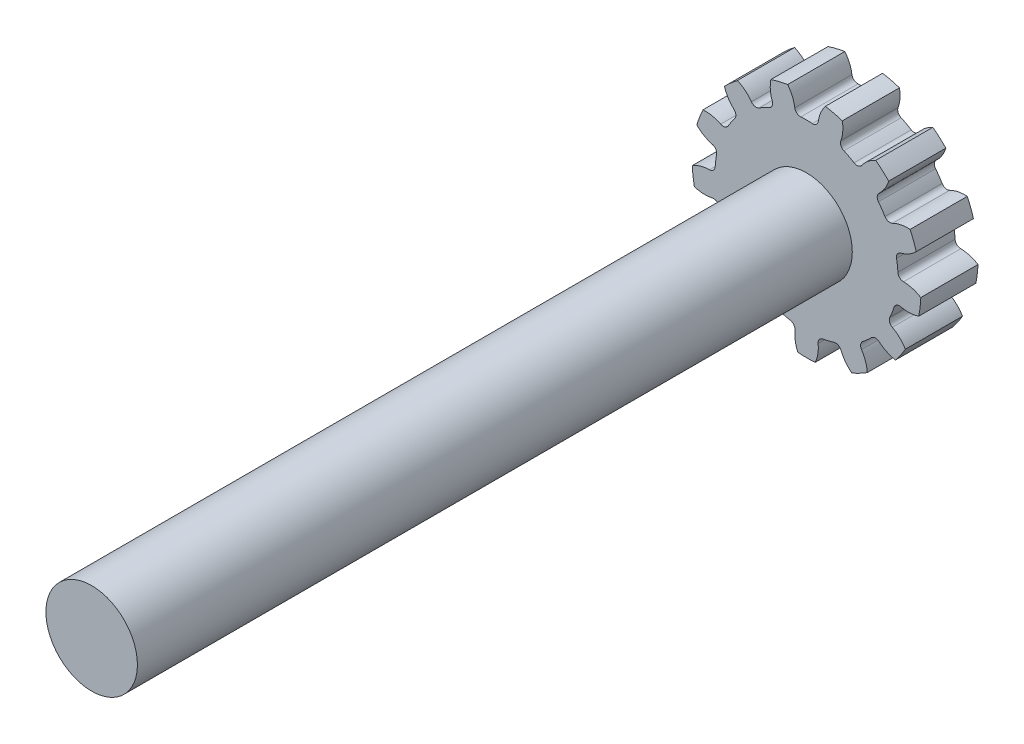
from build123d import *

# Parameters (mm, degrees)
IZIM1_R                     = 100
Y_KSEKLIK_EKSTR_ZYON1_DEPTH = 50
KES_EKSTR_ZYON1_DEPTH       = 50
DAIRESEL_O_ALTMA2_COUNT     = 13
IZIM3_R                     = 40
Y_KSEKLIK_EKSTR_ZYON2_DEPTH = 425
IZIM4_R                     = 40
Y_KSEKLIK_EKSTR_ZYON3_DEPTH = 150
IZIM5_R                     = 40
Y_KSEKLIK_EKSTR_ZYON4_DEPTH = 50


with BuildPart() as part:
    # izim1 → Y_kseklik-Ekstr_zyon1 (new body)
    with BuildSketch(Plane.XY):
        Circle(IZIM1_R)
    extrude(amount=Y_KSEKLIK_EKSTR_ZYON1_DEPTH)

    # izim2 → Kes-Ekstr_zyon1 (cut)
    with BuildSketch(Plane.XY.offset(50)):
        with BuildLine():
            ThreePointArc((5.021370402, 79.842255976), (0, 80), (-5.021370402, 79.842255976))
            ThreePointArc((-5.021370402, 79.842255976), (-8.497558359, 80.959474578), (-10.287319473, 84.142054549))
            ThreePointArc((-10.287319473, 84.142054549), (-15.592571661, 97.443550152), (-26.459340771, 106.770329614))
            ThreePointArc((-26.459340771, 106.770329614), (0, 110), (26.459340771, 106.770329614))
            ThreePointArc((26.459340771, 106.770329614), (15.592571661, 97.443550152), (10.287319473, 84.142054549))
            ThreePointArc((10.287319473, 84.142054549), (8.497558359, 80.959474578), (5.021370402, 79.842255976))
        make_face()
    kes_ekstr_zyon1 = extrude(amount=-KES_EKSTR_ZYON1_DEPTH, mode=Mode.SUBTRACT)

    # Dairesel _o_altma2: Kes-Ekstr_zyon1 ×13 about axis
    dairesel_o_altma2_axis = Axis((0, 0, 0), (0, 0, 1))
    for i in range(1, DAIRESEL_O_ALTMA2_COUNT):
        add(kes_ekstr_zyon1.rotate(dairesel_o_altma2_axis, i * 360 / DAIRESEL_O_ALTMA2_COUNT), mode=Mode.SUBTRACT)

    # izim3 → Y_kseklik-Ekstr_zyon2 (add)
    with BuildSketch(Plane.XY.offset(50)):
        Circle(IZIM3_R)
    extrude(amount=Y_KSEKLIK_EKSTR_ZYON2_DEPTH)

    # izim4 → Y_kseklik-Ekstr_zyon3 (add)
    with BuildSketch(Plane.XY.offset(475)):
        Circle(IZIM4_R)
    extrude(amount=Y_KSEKLIK_EKSTR_ZYON3_DEPTH)

    # izim5 → Y_kseklik-Ekstr_zyon4 (add)
    with BuildSketch(Plane.XY.offset(625)):
        Circle(IZIM5_R)
    extrude(amount=Y_KSEKLIK_EKSTR_ZYON4_DEPTH)


solid = part.part
